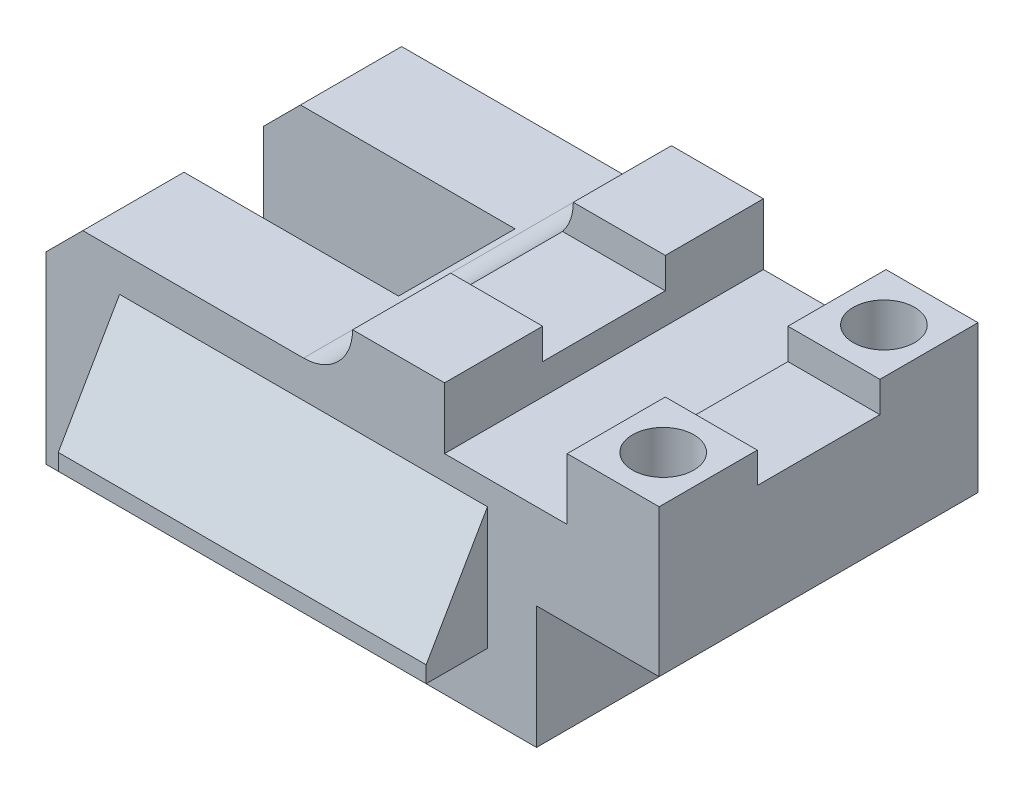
ISO-10303-21;
HEADER;
FILE_DESCRIPTION(('STEP AP214'),'2;1');
FILE_NAME('part.step','',(''),(''),'','','');
FILE_SCHEMA(('AUTOMOTIVE_DESIGN { 1 0 10303 214 1 1 1 1 }'));
ENDSEC;
DATA;
#1=APPLICATION_CONTEXT('core data for automotive mechanical design processes');
#2=APPLICATION_PROTOCOL_DEFINITION('international standard','automotive_design',2000,#1);
#3=PRODUCT_CONTEXT('',#1,'mechanical');
#4=PRODUCT('Part','Part','',(#3));
#5=PRODUCT_RELATED_PRODUCT_CATEGORY('part','',(#4));
#6=PRODUCT_DEFINITION_FORMATION('','',#4);
#7=PRODUCT_DEFINITION_CONTEXT('part definition',#1,'design');
#8=PRODUCT_DEFINITION('design','',#6,#7);
#9=PRODUCT_DEFINITION_SHAPE('','',#8);
#10=(LENGTH_UNIT() NAMED_UNIT(*) SI_UNIT(.MILLI.,.METRE.));
#11=(NAMED_UNIT(*) PLANE_ANGLE_UNIT() SI_UNIT($,.RADIAN.));
#12=(NAMED_UNIT(*) SI_UNIT($,.STERADIAN.) SOLID_ANGLE_UNIT());
#13=UNCERTAINTY_MEASURE_WITH_UNIT(LENGTH_MEASURE(1.E-05),#10,'distance_accuracy_value','');
#14=(GEOMETRIC_REPRESENTATION_CONTEXT(3) GLOBAL_UNCERTAINTY_ASSIGNED_CONTEXT((#13)) GLOBAL_UNIT_ASSIGNED_CONTEXT((#10,
#11,#12)) REPRESENTATION_CONTEXT('',''));
#15=CARTESIAN_POINT('',(0.,0.,0.));
#16=DIRECTION('',(0.,0.,1.));
#17=DIRECTION('',(1.,0.,0.));
#18=AXIS2_PLACEMENT_3D('',#15,#16,#17);
#19=CARTESIAN_POINT('',(0.,44.,26.));
#20=DIRECTION('',(0.,0.,-1.));
#21=DIRECTION('',(-1.,0.,0.));
#22=AXIS2_PLACEMENT_3D('',#19,#20,#21);
#23=PLANE('',#22);
#24=DIRECTION('',(1.,0.,0.));
#25=VECTOR('',#24,1.);
#26=CARTESIAN_POINT('',(0.,0.,26.));
#27=LINE('',#26,#25);
#28=CARTESIAN_POINT('',(-50.,0.,26.));
#29=VERTEX_POINT('',#28);
#30=CARTESIAN_POINT('',(30.,0.,26.));
#31=VERTEX_POINT('',#30);
#32=EDGE_CURVE('E473',#29,#31,#27,.T.);
#33=ORIENTED_EDGE('',*,*,#32,.T.);
#34=DIRECTION('',(0.,-1.,0.));
#35=VECTOR('',#34,1.);
#36=CARTESIAN_POINT('',(30.,0.,26.));
#37=LINE('',#36,#35);
#38=CARTESIAN_POINT('',(30.,20.,26.));
#39=VERTEX_POINT('',#38);
#40=EDGE_CURVE('E293',#39,#31,#37,.T.);
#41=ORIENTED_EDGE('',*,*,#40,.F.);
#42=DIRECTION('',(-1.,0.,0.));
#43=VECTOR('',#42,1.);
#44=CARTESIAN_POINT('',(50.,20.,26.));
#45=LINE('',#44,#43);
#46=CARTESIAN_POINT('',(50.,20.,26.));
#47=VERTEX_POINT('',#46);
#48=EDGE_CURVE('E265',#47,#39,#45,.T.);
#49=ORIENTED_EDGE('',*,*,#48,.F.);
#50=DIRECTION('',(0.,-1.,0.));
#51=VECTOR('',#50,1.);
#52=CARTESIAN_POINT('',(50.,44.,26.));
#53=LINE('',#52,#51);
#54=CARTESIAN_POINT('',(50.,44.,26.));
#55=VERTEX_POINT('',#54);
#56=EDGE_CURVE('E498',#55,#47,#53,.T.);
#57=ORIENTED_EDGE('',*,*,#56,.F.);
#58=DIRECTION('',(1.,0.,0.));
#59=VECTOR('',#58,1.);
#60=CARTESIAN_POINT('',(0.,44.,26.));
#61=LINE('',#60,#59);
#62=CARTESIAN_POINT('',(35.,44.,26.));
#63=VERTEX_POINT('',#62);
#64=EDGE_CURVE('E452',#63,#55,#61,.T.);
#65=ORIENTED_EDGE('',*,*,#64,.F.);
#66=DIRECTION('',(0.,1.,0.));
#67=VECTOR('',#66,1.);
#68=CARTESIAN_POINT('',(35.,34.,26.));
#69=LINE('',#68,#67);
#70=CARTESIAN_POINT('',(35.,34.,26.));
#71=VERTEX_POINT('',#70);
#72=EDGE_CURVE('E397',#71,#63,#69,.T.);
#73=ORIENTED_EDGE('',*,*,#72,.F.);
#74=DIRECTION('',(1.,0.,0.));
#75=VECTOR('',#74,1.);
#76=CARTESIAN_POINT('',(0.,34.,26.));
#77=LINE('',#76,#75);
#78=CARTESIAN_POINT('',(15.,34.,26.));
#79=VERTEX_POINT('',#78);
#80=EDGE_CURVE('E384',#79,#71,#77,.T.);
#81=ORIENTED_EDGE('',*,*,#80,.F.);
#82=DIRECTION('',(0.,1.,0.));
#83=VECTOR('',#82,1.);
#84=CARTESIAN_POINT('',(15.,34.,26.));
#85=LINE('',#84,#83);
#86=CARTESIAN_POINT('',(15.,44.,26.));
#87=VERTEX_POINT('',#86);
#88=EDGE_CURVE('E401',#79,#87,#85,.T.);
#89=ORIENTED_EDGE('',*,*,#88,.T.);
#90=CARTESIAN_POINT('',(0.,44.,26.));
#91=VERTEX_POINT('',#90);
#92=EDGE_CURVE('E448',#91,#87,#61,.T.);
#93=ORIENTED_EDGE('',*,*,#92,.F.);
#94=CARTESIAN_POINT('',(-7.99999999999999,44.,26.));
#95=DIRECTION('',(0.,0.,-1.));
#96=DIRECTION('',(-1.,0.,0.));
#97=AXIS2_PLACEMENT_3D('',#94,#95,#96);
#98=CIRCLE('',#97,8.);
#99=CARTESIAN_POINT('',(-7.99999999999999,36.,26.));
#100=VERTEX_POINT('',#99);
#101=EDGE_CURVE('E552',#91,#100,#98,.T.);
#102=ORIENTED_EDGE('',*,*,#101,.T.);
#103=DIRECTION('',(1.,0.,0.));
#104=VECTOR('',#103,1.);
#105=CARTESIAN_POINT('',(0.,36.,26.));
#106=LINE('',#105,#104);
#107=CARTESIAN_POINT('',(-44.,36.,26.));
#108=VERTEX_POINT('',#107);
#109=EDGE_CURVE('E340',#108,#100,#106,.T.);
#110=ORIENTED_EDGE('',*,*,#109,.F.);
#111=DIRECTION('',(-0.707106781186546,-0.707106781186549,0.));
#112=VECTOR('',#111,1.);
#113=CARTESIAN_POINT('',(-44.,36.,26.));
#114=LINE('',#113,#112);
#115=CARTESIAN_POINT('',(-50.,30.,26.));
#116=VERTEX_POINT('',#115);
#117=EDGE_CURVE('E519',#108,#116,#114,.T.);
#118=ORIENTED_EDGE('',*,*,#117,.T.);
#119=DIRECTION('',(0.,-1.,0.));
#120=VECTOR('',#119,1.);
#121=CARTESIAN_POINT('',(-50.,44.,26.));
#122=LINE('',#121,#120);
#123=EDGE_CURVE('E502',#116,#29,#122,.T.);
#124=ORIENTED_EDGE('',*,*,#123,.T.);
#125=EDGE_LOOP('',(#33,#41,#49,#57,#65,#73,#81,#89,#93,#102,#110,#118,#124));
#126=FACE_BOUND('',#125,.T.);
#127=DIRECTION('',(-1.,0.,0.));
#128=VECTOR('',#127,1.);
#129=CARTESIAN_POINT('',(22.,30.,26.));
#130=LINE('',#129,#128);
#131=CARTESIAN_POINT('',(22.,30.,26.));
#132=VERTEX_POINT('',#131);
#133=CARTESIAN_POINT('',(-38.,30.,26.));
#134=VERTEX_POINT('',#133);
#135=EDGE_CURVE('E276',#132,#134,#130,.T.);
#136=ORIENTED_EDGE('',*,*,#135,.F.);
#137=DIRECTION('',(0.,1.,0.));
#138=VECTOR('',#137,1.);
#139=CARTESIAN_POINT('',(22.,10.,26.));
#140=LINE('',#139,#138);
#141=CARTESIAN_POINT('',(22.,10.,26.));
#142=VERTEX_POINT('',#141);
#143=EDGE_CURVE('E254',#142,#132,#140,.T.);
#144=ORIENTED_EDGE('',*,*,#143,.F.);
#145=DIRECTION('',(1.,0.,0.));
#146=VECTOR('',#145,1.);
#147=CARTESIAN_POINT('',(-38.,10.,26.));
#148=LINE('',#147,#146);
#149=CARTESIAN_POINT('',(-38.,10.,26.));
#150=VERTEX_POINT('',#149);
#151=EDGE_CURVE('E281',#150,#142,#148,.T.);
#152=ORIENTED_EDGE('',*,*,#151,.F.);
#153=DIRECTION('',(0.,-1.,0.));
#154=VECTOR('',#153,1.);
#155=CARTESIAN_POINT('',(-38.,30.,26.));
#156=LINE('',#155,#154);
#157=EDGE_CURVE('E261',#134,#150,#156,.T.);
#158=ORIENTED_EDGE('',*,*,#157,.F.);
#159=EDGE_LOOP('',(#136,#144,#152,#158));
#160=FACE_BOUND('',#159,.T.);
#161=ADVANCED_FACE('F47',(#126,#160),#23,.F.);
#162=CARTESIAN_POINT('',(0.,44.,-26.));
#163=DIRECTION('',(0.,0.,-1.));
#164=DIRECTION('',(-1.,0.,0.));
#165=AXIS2_PLACEMENT_3D('',#162,#163,#164);
#166=PLANE('',#165);
#167=DIRECTION('',(0.,-1.,0.));
#168=VECTOR('',#167,1.);
#169=CARTESIAN_POINT('',(30.,0.,-26.));
#170=LINE('',#169,#168);
#171=CARTESIAN_POINT('',(30.,20.,-26.));
#172=VERTEX_POINT('',#171);
#173=CARTESIAN_POINT('',(30.,0.,-26.));
#174=VERTEX_POINT('',#173);
#175=EDGE_CURVE('E292',#172,#174,#170,.T.);
#176=ORIENTED_EDGE('',*,*,#175,.T.);
#177=DIRECTION('',(1.,0.,0.));
#178=VECTOR('',#177,1.);
#179=CARTESIAN_POINT('',(0.,0.,-26.));
#180=LINE('',#179,#178);
#181=CARTESIAN_POINT('',(-50.,0.,-26.));
#182=VERTEX_POINT('',#181);
#183=EDGE_CURVE('E478',#182,#174,#180,.T.);
#184=ORIENTED_EDGE('',*,*,#183,.F.);
#185=DIRECTION('',(0.,-1.,0.));
#186=VECTOR('',#185,1.);
#187=CARTESIAN_POINT('',(-50.,44.,-26.));
#188=LINE('',#187,#186);
#189=CARTESIAN_POINT('',(-50.,30.,-26.));
#190=VERTEX_POINT('',#189);
#191=EDGE_CURVE('E491',#190,#182,#188,.T.);
#192=ORIENTED_EDGE('',*,*,#191,.F.);
#193=DIRECTION('',(0.707106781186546,0.707106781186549,0.));
#194=VECTOR('',#193,1.);
#195=CARTESIAN_POINT('',(-18.0000000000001,62.,-26.));
#196=LINE('',#195,#194);
#197=CARTESIAN_POINT('',(-44.,36.,-26.));
#198=VERTEX_POINT('',#197);
#199=EDGE_CURVE('E534',#190,#198,#196,.T.);
#200=ORIENTED_EDGE('',*,*,#199,.T.);
#201=DIRECTION('',(-1.,0.,0.));
#202=VECTOR('',#201,1.);
#203=CARTESIAN_POINT('',(0.,36.,-26.));
#204=LINE('',#203,#202);
#205=CARTESIAN_POINT('',(-8.00000000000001,36.,-26.));
#206=VERTEX_POINT('',#205);
#207=EDGE_CURVE('E326',#206,#198,#204,.T.);
#208=ORIENTED_EDGE('',*,*,#207,.F.);
#209=CARTESIAN_POINT('',(-8.00000000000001,44.,-26.));
#210=DIRECTION('',(0.,0.,-1.));
#211=DIRECTION('',(-1.,0.,0.));
#212=AXIS2_PLACEMENT_3D('',#209,#210,#211);
#213=CIRCLE('',#212,8.);
#214=CARTESIAN_POINT('',(0.,44.,-26.));
#215=VERTEX_POINT('',#214);
#216=EDGE_CURVE('E555',#206,#215,#213,.F.);
#217=ORIENTED_EDGE('',*,*,#216,.T.);
#218=DIRECTION('',(1.,0.,0.));
#219=VECTOR('',#218,1.);
#220=CARTESIAN_POINT('',(0.,44.,-26.));
#221=LINE('',#220,#219);
#222=CARTESIAN_POINT('',(15.,44.,-26.));
#223=VERTEX_POINT('',#222);
#224=EDGE_CURVE('E458',#215,#223,#221,.T.);
#225=ORIENTED_EDGE('',*,*,#224,.T.);
#226=DIRECTION('',(0.,1.,0.));
#227=VECTOR('',#226,1.);
#228=CARTESIAN_POINT('',(15.,34.,-26.));
#229=LINE('',#228,#227);
#230=CARTESIAN_POINT('',(15.,34.,-26.));
#231=VERTEX_POINT('',#230);
#232=EDGE_CURVE('E405',#231,#223,#229,.T.);
#233=ORIENTED_EDGE('',*,*,#232,.F.);
#234=DIRECTION('',(-1.,0.,0.));
#235=VECTOR('',#234,1.);
#236=CARTESIAN_POINT('',(0.,34.,-26.));
#237=LINE('',#236,#235);
#238=CARTESIAN_POINT('',(35.,34.,-26.));
#239=VERTEX_POINT('',#238);
#240=EDGE_CURVE('E375',#239,#231,#237,.T.);
#241=ORIENTED_EDGE('',*,*,#240,.F.);
#242=DIRECTION('',(0.,1.,0.));
#243=VECTOR('',#242,1.);
#244=CARTESIAN_POINT('',(35.,34.,-26.));
#245=LINE('',#244,#243);
#246=CARTESIAN_POINT('',(35.,44.,-26.));
#247=VERTEX_POINT('',#246);
#248=EDGE_CURVE('E388',#239,#247,#245,.T.);
#249=ORIENTED_EDGE('',*,*,#248,.T.);
#250=CARTESIAN_POINT('',(50.,44.,-26.));
#251=VERTEX_POINT('',#250);
#252=EDGE_CURVE('E457',#247,#251,#221,.T.);
#253=ORIENTED_EDGE('',*,*,#252,.T.);
#254=DIRECTION('',(0.,-1.,0.));
#255=VECTOR('',#254,1.);
#256=CARTESIAN_POINT('',(50.,44.,-26.));
#257=LINE('',#256,#255);
#258=CARTESIAN_POINT('',(50.,20.,-26.));
#259=VERTEX_POINT('',#258);
#260=EDGE_CURVE('E494',#251,#259,#257,.T.);
#261=ORIENTED_EDGE('',*,*,#260,.T.);
#262=DIRECTION('',(-1.,0.,0.));
#263=VECTOR('',#262,1.);
#264=CARTESIAN_POINT('',(50.,20.,-26.));
#265=LINE('',#264,#263);
#266=EDGE_CURVE('E288',#259,#172,#265,.T.);
#267=ORIENTED_EDGE('',*,*,#266,.T.);
#268=EDGE_LOOP('',(#176,#184,#192,#200,#208,#217,#225,#233,#241,#249,#253,#261,#267));
#269=FACE_BOUND('',#268,.T.);
#270=ADVANCED_FACE('F571',(#269),#166,.T.);
#271=CARTESIAN_POINT('',(-8.99999999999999,44.,0.));
#272=DIRECTION('',(1.,0.,0.));
#273=DIRECTION('',(0.,0.,-1.));
#274=AXIS2_PLACEMENT_3D('',#271,#272,#273);
#275=PLANE('',#274);
#276=DIRECTION('',(0.,0.,1.));
#277=VECTOR('',#276,1.);
#278=CARTESIAN_POINT('',(-8.99999999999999,36.,0.));
#279=LINE('',#278,#277);
#280=CARTESIAN_POINT('',(-8.99999999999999,36.,-9.5));
#281=VERTEX_POINT('',#280);
#282=CARTESIAN_POINT('',(-8.99999999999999,36.,9.5));
#283=VERTEX_POINT('',#282);
#284=EDGE_CURVE('E333',#281,#283,#279,.T.);
#285=ORIENTED_EDGE('',*,*,#284,.F.);
#286=DIRECTION('',(0.,-1.,0.));
#287=VECTOR('',#286,1.);
#288=CARTESIAN_POINT('',(-8.99999999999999,44.,-9.5));
#289=LINE('',#288,#287);
#290=CARTESIAN_POINT('',(-8.99999999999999,0.,-9.5));
#291=VERTEX_POINT('',#290);
#292=EDGE_CURVE('E461',#281,#291,#289,.T.);
#293=ORIENTED_EDGE('',*,*,#292,.T.);
#294=DIRECTION('',(0.,0.,1.));
#295=VECTOR('',#294,1.);
#296=CARTESIAN_POINT('',(-8.99999999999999,0.,0.));
#297=LINE('',#296,#295);
#298=CARTESIAN_POINT('',(-8.99999999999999,0.,9.5));
#299=VERTEX_POINT('',#298);
#300=EDGE_CURVE('E437',#291,#299,#297,.T.);
#301=ORIENTED_EDGE('',*,*,#300,.T.);
#302=DIRECTION('',(0.,-1.,0.));
#303=VECTOR('',#302,1.);
#304=CARTESIAN_POINT('',(-8.99999999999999,44.,9.5));
#305=LINE('',#304,#303);
#306=EDGE_CURVE('E508',#283,#299,#305,.T.);
#307=ORIENTED_EDGE('',*,*,#306,.F.);
#308=EDGE_LOOP('',(#285,#293,#301,#307));
#309=FACE_BOUND('',#308,.T.);
#310=ADVANCED_FACE('F577',(#309),#275,.F.);
#311=CARTESIAN_POINT('',(0.,44.,9.5));
#312=DIRECTION('',(0.,0.,1.));
#313=DIRECTION('',(1.,0.,0.));
#314=AXIS2_PLACEMENT_3D('',#311,#312,#313);
#315=PLANE('',#314);
#316=DIRECTION('',(0.,-1.,0.));
#317=VECTOR('',#316,1.);
#318=CARTESIAN_POINT('',(-50.,44.,9.5));
#319=LINE('',#318,#317);
#320=CARTESIAN_POINT('',(-50.,30.,9.5));
#321=VERTEX_POINT('',#320);
#322=CARTESIAN_POINT('',(-50.,0.,9.5));
#323=VERTEX_POINT('',#322);
#324=EDGE_CURVE('E505',#321,#323,#319,.T.);
#325=ORIENTED_EDGE('',*,*,#324,.F.);
#326=DIRECTION('',(0.707106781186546,0.707106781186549,0.));
#327=VECTOR('',#326,1.);
#328=CARTESIAN_POINT('',(-44.,36.,9.5));
#329=LINE('',#328,#327);
#330=CARTESIAN_POINT('',(-44.,36.,9.5));
#331=VERTEX_POINT('',#330);
#332=EDGE_CURVE('E525',#321,#331,#329,.T.);
#333=ORIENTED_EDGE('',*,*,#332,.T.);
#334=DIRECTION('',(-1.,0.,0.));
#335=VECTOR('',#334,1.);
#336=CARTESIAN_POINT('',(0.,36.,9.5));
#337=LINE('',#336,#335);
#338=EDGE_CURVE('E336',#283,#331,#337,.T.);
#339=ORIENTED_EDGE('',*,*,#338,.F.);
#340=ORIENTED_EDGE('',*,*,#306,.T.);
#341=DIRECTION('',(-1.,0.,0.));
#342=VECTOR('',#341,1.);
#343=CARTESIAN_POINT('',(0.,0.,9.5));
#344=LINE('',#343,#342);
#345=EDGE_CURVE('E465',#299,#323,#344,.T.);
#346=ORIENTED_EDGE('',*,*,#345,.T.);
#347=EDGE_LOOP('',(#325,#333,#339,#340,#346));
#348=FACE_BOUND('',#347,.T.);
#349=ADVANCED_FACE('F583',(#348),#315,.F.);
#350=CARTESIAN_POINT('',(-50.,44.,0.));
#351=DIRECTION('',(1.,0.,0.));
#352=DIRECTION('',(0.,0.,-1.));
#353=AXIS2_PLACEMENT_3D('',#350,#351,#352);
#354=PLANE('',#353);
#355=ORIENTED_EDGE('',*,*,#123,.F.);
#356=DIRECTION('',(0.,0.,-1.));
#357=VECTOR('',#356,1.);
#358=CARTESIAN_POINT('',(-50.,30.,9.5));
#359=LINE('',#358,#357);
#360=EDGE_CURVE('E522',#116,#321,#359,.T.);
#361=ORIENTED_EDGE('',*,*,#360,.T.);
#362=ORIENTED_EDGE('',*,*,#324,.T.);
#363=DIRECTION('',(0.,0.,1.));
#364=VECTOR('',#363,1.);
#365=CARTESIAN_POINT('',(-50.,0.,0.));
#366=LINE('',#365,#364);
#367=EDGE_CURVE('E469',#323,#29,#366,.T.);
#368=ORIENTED_EDGE('',*,*,#367,.T.);
#369=EDGE_LOOP('',(#355,#361,#362,#368));
#370=FACE_BOUND('',#369,.T.);
#371=ADVANCED_FACE('F586',(#370),#354,.F.);
#372=DIRECTION('',(0.,-1.,0.));
#373=VECTOR('',#372,1.);
#374=CARTESIAN_POINT('',(-50.,44.,-9.5));
#375=LINE('',#374,#373);
#376=CARTESIAN_POINT('',(-50.,30.,-9.5));
#377=VERTEX_POINT('',#376);
#378=CARTESIAN_POINT('',(-50.,0.,-9.5));
#379=VERTEX_POINT('',#378);
#380=EDGE_CURVE('E488',#377,#379,#375,.T.);
#381=ORIENTED_EDGE('',*,*,#380,.F.);
#382=DIRECTION('',(0.,0.,-1.));
#383=VECTOR('',#382,1.);
#384=CARTESIAN_POINT('',(-50.,30.,-26.));
#385=LINE('',#384,#383);
#386=EDGE_CURVE('E531',#377,#190,#385,.T.);
#387=ORIENTED_EDGE('',*,*,#386,.T.);
#388=ORIENTED_EDGE('',*,*,#191,.T.);
#389=EDGE_CURVE('E474',#182,#379,#366,.T.);
#390=ORIENTED_EDGE('',*,*,#389,.T.);
#391=EDGE_LOOP('',(#381,#387,#388,#390));
#392=FACE_BOUND('',#391,.T.);
#393=ADVANCED_FACE('F714',(#392),#354,.F.);
#394=CARTESIAN_POINT('',(0.,44.,-9.5));
#395=DIRECTION('',(0.,0.,-1.));
#396=DIRECTION('',(-1.,0.,0.));
#397=AXIS2_PLACEMENT_3D('',#394,#395,#396);
#398=PLANE('',#397);
#399=DIRECTION('',(1.,0.,0.));
#400=VECTOR('',#399,1.);
#401=CARTESIAN_POINT('',(0.,36.,-9.5));
#402=LINE('',#401,#400);
#403=CARTESIAN_POINT('',(-44.,36.,-9.5));
#404=VERTEX_POINT('',#403);
#405=EDGE_CURVE('E329',#404,#281,#402,.T.);
#406=ORIENTED_EDGE('',*,*,#405,.F.);
#407=DIRECTION('',(-0.707106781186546,-0.707106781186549,0.));
#408=VECTOR('',#407,1.);
#409=CARTESIAN_POINT('',(-44.,36.,-9.5));
#410=LINE('',#409,#408);
#411=EDGE_CURVE('E528',#404,#377,#410,.T.);
#412=ORIENTED_EDGE('',*,*,#411,.T.);
#413=ORIENTED_EDGE('',*,*,#380,.T.);
#414=DIRECTION('',(1.,0.,0.));
#415=VECTOR('',#414,1.);
#416=CARTESIAN_POINT('',(0.,0.,-9.5));
#417=LINE('',#416,#415);
#418=EDGE_CURVE('E482',#379,#291,#417,.T.);
#419=ORIENTED_EDGE('',*,*,#418,.T.);
#420=ORIENTED_EDGE('',*,*,#292,.F.);
#421=EDGE_LOOP('',(#406,#412,#413,#419,#420));
#422=FACE_BOUND('',#421,.T.);
#423=ADVANCED_FACE('F707',(#422),#398,.F.);
#424=CARTESIAN_POINT('',(0.,44.,0.));
#425=DIRECTION('',(0.,1.,0.));
#426=DIRECTION('',(0.,0.,1.));
#427=AXIS2_PLACEMENT_3D('',#424,#425,#426);
#428=PLANE('',#427);
#429=ORIENTED_EDGE('',*,*,#224,.F.);
#430=DIRECTION('',(0.,0.,1.));
#431=VECTOR('',#430,1.);
#432=CARTESIAN_POINT('',(0.,44.,0.));
#433=LINE('',#432,#431);
#434=CARTESIAN_POINT('',(0.,44.,-9.99999999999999));
#435=VERTEX_POINT('',#434);
#436=EDGE_CURVE('E330',#215,#435,#433,.T.);
#437=ORIENTED_EDGE('',*,*,#436,.T.);
#438=DIRECTION('',(-1.,0.,0.));
#439=VECTOR('',#438,1.);
#440=CARTESIAN_POINT('',(0.,44.,-9.99999999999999));
#441=LINE('',#440,#439);
#442=CARTESIAN_POINT('',(15.,44.,-10.));
#443=VERTEX_POINT('',#442);
#444=EDGE_CURVE('E352',#443,#435,#441,.T.);
#445=ORIENTED_EDGE('',*,*,#444,.F.);
#446=DIRECTION('',(0.,0.,1.));
#447=VECTOR('',#446,1.);
#448=CARTESIAN_POINT('',(15.,44.,0.));
#449=LINE('',#448,#447);
#450=EDGE_CURVE('E376',#223,#443,#449,.T.);
#451=ORIENTED_EDGE('',*,*,#450,.F.);
#452=EDGE_LOOP('',(#429,#437,#445,#451));
#453=FACE_BOUND('',#452,.T.);
#454=ADVANCED_FACE('F624',(#453),#428,.T.);
#455=DIRECTION('',(1.,0.,0.));
#456=VECTOR('',#455,1.);
#457=CARTESIAN_POINT('',(0.,44.,10.));
#458=LINE('',#457,#456);
#459=CARTESIAN_POINT('',(0.,44.,10.));
#460=VERTEX_POINT('',#459);
#461=CARTESIAN_POINT('',(15.,44.,10.));
#462=VERTEX_POINT('',#461);
#463=EDGE_CURVE('E344',#460,#462,#458,.T.);
#464=ORIENTED_EDGE('',*,*,#463,.F.);
#465=EDGE_CURVE('E322',#460,#91,#433,.T.);
#466=ORIENTED_EDGE('',*,*,#465,.T.);
#467=ORIENTED_EDGE('',*,*,#92,.T.);
#468=EDGE_CURVE('E393',#462,#87,#449,.T.);
#469=ORIENTED_EDGE('',*,*,#468,.F.);
#470=EDGE_LOOP('',(#464,#466,#467,#469));
#471=FACE_BOUND('',#470,.T.);
#472=ADVANCED_FACE('F666',(#471),#428,.T.);
#473=CARTESIAN_POINT('',(42.6566955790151,44.,-18.));
#474=DIRECTION('',(0.,1.,0.));
#475=DIRECTION('',(0.,0.,1.));
#476=AXIS2_PLACEMENT_3D('',#473,#474,#475);
#477=CIRCLE('',#476,5.);
#478=CARTESIAN_POINT('',(42.6566955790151,44.,-13.));
#479=VERTEX_POINT('',#478);
#480=EDGE_CURVE('E318',#479,#479,#477,.T.);
#481=ORIENTED_EDGE('',*,*,#480,.F.);
#482=EDGE_LOOP('',(#481));
#483=FACE_BOUND('',#482,.T.);
#484=ORIENTED_EDGE('',*,*,#252,.F.);
#485=DIRECTION('',(0.,0.,1.));
#486=VECTOR('',#485,1.);
#487=CARTESIAN_POINT('',(35.,44.,0.));
#488=LINE('',#487,#486);
#489=CARTESIAN_POINT('',(35.,44.,-9.99999999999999));
#490=VERTEX_POINT('',#489);
#491=EDGE_CURVE('E389',#247,#490,#488,.T.);
#492=ORIENTED_EDGE('',*,*,#491,.T.);
#493=DIRECTION('',(-1.,0.,0.));
#494=VECTOR('',#493,1.);
#495=CARTESIAN_POINT('',(0.,44.,-9.99999999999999));
#496=LINE('',#495,#494);
#497=CARTESIAN_POINT('',(50.,44.,-10.));
#498=VERTEX_POINT('',#497);
#499=EDGE_CURVE('E417',#498,#490,#496,.T.);
#500=ORIENTED_EDGE('',*,*,#499,.F.);
#501=DIRECTION('',(0.,0.,1.));
#502=VECTOR('',#501,1.);
#503=CARTESIAN_POINT('',(50.,44.,0.));
#504=LINE('',#503,#502);
#505=EDGE_CURVE('E453',#251,#498,#504,.T.);
#506=ORIENTED_EDGE('',*,*,#505,.F.);
#507=EDGE_LOOP('',(#484,#492,#500,#506));
#508=FACE_BOUND('',#507,.T.);
#509=ADVANCED_FACE('F642',(#483,#508),#428,.T.);
#510=CARTESIAN_POINT('',(42.6566955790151,44.,18.));
#511=DIRECTION('',(0.,1.,0.));
#512=DIRECTION('',(0.,0.,1.));
#513=AXIS2_PLACEMENT_3D('',#510,#511,#512);
#514=CIRCLE('',#513,5.);
#515=CARTESIAN_POINT('',(42.6566955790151,44.,23.));
#516=VERTEX_POINT('',#515);
#517=EDGE_CURVE('E317',#516,#516,#514,.T.);
#518=ORIENTED_EDGE('',*,*,#517,.F.);
#519=EDGE_LOOP('',(#518));
#520=FACE_BOUND('',#519,.T.);
#521=DIRECTION('',(1.,0.,0.));
#522=VECTOR('',#521,1.);
#523=CARTESIAN_POINT('',(0.,44.,10.));
#524=LINE('',#523,#522);
#525=CARTESIAN_POINT('',(35.,44.,10.));
#526=VERTEX_POINT('',#525);
#527=CARTESIAN_POINT('',(50.,44.,10.));
#528=VERTEX_POINT('',#527);
#529=EDGE_CURVE('E400',#526,#528,#524,.T.);
#530=ORIENTED_EDGE('',*,*,#529,.F.);
#531=EDGE_CURVE('E368',#526,#63,#488,.T.);
#532=ORIENTED_EDGE('',*,*,#531,.T.);
#533=ORIENTED_EDGE('',*,*,#64,.T.);
#534=EDGE_CURVE('E451',#528,#55,#504,.T.);
#535=ORIENTED_EDGE('',*,*,#534,.F.);
#536=EDGE_LOOP('',(#530,#532,#533,#535));
#537=FACE_BOUND('',#536,.T.);
#538=ADVANCED_FACE('F708',(#520,#537),#428,.T.);
#539=CARTESIAN_POINT('',(50.,44.,0.));
#540=DIRECTION('',(1.,0.,0.));
#541=DIRECTION('',(0.,0.,-1.));
#542=AXIS2_PLACEMENT_3D('',#539,#540,#541);
#543=PLANE('',#542);
#544=DIRECTION('',(0.,0.,1.));
#545=VECTOR('',#544,1.);
#546=CARTESIAN_POINT('',(50.,20.,-26.));
#547=LINE('',#546,#545);
#548=EDGE_CURVE('E297',#259,#47,#547,.T.);
#549=ORIENTED_EDGE('',*,*,#548,.F.);
#550=ORIENTED_EDGE('',*,*,#260,.F.);
#551=ORIENTED_EDGE('',*,*,#505,.T.);
#552=DIRECTION('',(0.,1.,0.));
#553=VECTOR('',#552,1.);
#554=CARTESIAN_POINT('',(50.,39.,-10.));
#555=LINE('',#554,#553);
#556=CARTESIAN_POINT('',(50.,39.,-10.));
#557=VERTEX_POINT('',#556);
#558=EDGE_CURVE('E438',#557,#498,#555,.T.);
#559=ORIENTED_EDGE('',*,*,#558,.F.);
#560=DIRECTION('',(0.,0.,-1.));
#561=VECTOR('',#560,1.);
#562=CARTESIAN_POINT('',(50.,39.,0.));
#563=LINE('',#562,#561);
#564=CARTESIAN_POINT('',(50.,39.,10.));
#565=VERTEX_POINT('',#564);
#566=EDGE_CURVE('E421',#565,#557,#563,.T.);
#567=ORIENTED_EDGE('',*,*,#566,.F.);
#568=DIRECTION('',(0.,1.,0.));
#569=VECTOR('',#568,1.);
#570=CARTESIAN_POINT('',(50.,39.,10.));
#571=LINE('',#570,#569);
#572=EDGE_CURVE('E441',#565,#528,#571,.T.);
#573=ORIENTED_EDGE('',*,*,#572,.T.);
#574=ORIENTED_EDGE('',*,*,#534,.T.);
#575=ORIENTED_EDGE('',*,*,#56,.T.);
#576=EDGE_LOOP('',(#549,#550,#551,#559,#567,#573,#574,#575));
#577=FACE_BOUND('',#576,.T.);
#578=ADVANCED_FACE('F582',(#577),#543,.T.);
#579=CARTESIAN_POINT('',(0.,0.,0.));
#580=DIRECTION('',(0.,1.,0.));
#581=DIRECTION('',(0.,0.,1.));
#582=AXIS2_PLACEMENT_3D('',#579,#580,#581);
#583=PLANE('',#582);
#584=ORIENTED_EDGE('',*,*,#183,.T.);
#585=DIRECTION('',(0.,0.,1.));
#586=VECTOR('',#585,1.);
#587=CARTESIAN_POINT('',(30.,0.,-26.));
#588=LINE('',#587,#586);
#589=EDGE_CURVE('E303',#174,#31,#588,.T.);
#590=ORIENTED_EDGE('',*,*,#589,.T.);
#591=ORIENTED_EDGE('',*,*,#32,.F.);
#592=ORIENTED_EDGE('',*,*,#367,.F.);
#593=ORIENTED_EDGE('',*,*,#345,.F.);
#594=ORIENTED_EDGE('',*,*,#300,.F.);
#595=ORIENTED_EDGE('',*,*,#418,.F.);
#596=ORIENTED_EDGE('',*,*,#389,.F.);
#597=EDGE_LOOP('',(#584,#590,#591,#592,#593,#594,#595,#596));
#598=FACE_BOUND('',#597,.T.);
#599=ADVANCED_FACE('F701',(#598),#583,.F.);
#600=CARTESIAN_POINT('',(0.,39.,-9.99999999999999));
#601=DIRECTION('',(0.,0.,-1.));
#602=DIRECTION('',(-1.,0.,0.));
#603=AXIS2_PLACEMENT_3D('',#600,#601,#602);
#604=PLANE('',#603);
#605=ORIENTED_EDGE('',*,*,#499,.T.);
#606=DIRECTION('',(0.,1.,0.));
#607=VECTOR('',#606,1.);
#608=CARTESIAN_POINT('',(35.,39.,-9.99999999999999));
#609=LINE('',#608,#607);
#610=CARTESIAN_POINT('',(35.,39.,-10.));
#611=VERTEX_POINT('',#610);
#612=EDGE_CURVE('E434',#611,#490,#609,.T.);
#613=ORIENTED_EDGE('',*,*,#612,.F.);
#614=DIRECTION('',(-1.,0.,0.));
#615=VECTOR('',#614,1.);
#616=CARTESIAN_POINT('',(0.,39.,-9.99999999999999));
#617=LINE('',#616,#615);
#618=EDGE_CURVE('E424',#557,#611,#617,.T.);
#619=ORIENTED_EDGE('',*,*,#618,.F.);
#620=ORIENTED_EDGE('',*,*,#558,.T.);
#621=EDGE_LOOP('',(#605,#613,#619,#620));
#622=FACE_BOUND('',#621,.T.);
#623=ADVANCED_FACE('F645',(#622),#604,.F.);
#624=CARTESIAN_POINT('',(0.,39.,10.));
#625=DIRECTION('',(0.,0.,1.));
#626=DIRECTION('',(1.,0.,0.));
#627=AXIS2_PLACEMENT_3D('',#624,#625,#626);
#628=PLANE('',#627);
#629=ORIENTED_EDGE('',*,*,#529,.T.);
#630=ORIENTED_EDGE('',*,*,#572,.F.);
#631=DIRECTION('',(1.,0.,0.));
#632=VECTOR('',#631,1.);
#633=CARTESIAN_POINT('',(0.,39.,10.));
#634=LINE('',#633,#632);
#635=CARTESIAN_POINT('',(35.,39.,10.));
#636=VERTEX_POINT('',#635);
#637=EDGE_CURVE('E416',#636,#565,#634,.T.);
#638=ORIENTED_EDGE('',*,*,#637,.F.);
#639=DIRECTION('',(0.,1.,0.));
#640=VECTOR('',#639,1.);
#641=CARTESIAN_POINT('',(35.,39.,10.));
#642=LINE('',#641,#640);
#643=EDGE_CURVE('E428',#636,#526,#642,.T.);
#644=ORIENTED_EDGE('',*,*,#643,.T.);
#645=EDGE_LOOP('',(#629,#630,#638,#644));
#646=FACE_BOUND('',#645,.T.);
#647=ADVANCED_FACE('F697',(#646),#628,.F.);
#648=CARTESIAN_POINT('',(0.,39.,0.));
#649=DIRECTION('',(0.,1.,0.));
#650=DIRECTION('',(0.,0.,1.));
#651=AXIS2_PLACEMENT_3D('',#648,#649,#650);
#652=PLANE('',#651);
#653=DIRECTION('',(0.,0.,1.));
#654=VECTOR('',#653,1.);
#655=CARTESIAN_POINT('',(35.,39.,0.));
#656=LINE('',#655,#654);
#657=EDGE_CURVE('E412',#611,#636,#656,.T.);
#658=ORIENTED_EDGE('',*,*,#657,.T.);
#659=ORIENTED_EDGE('',*,*,#637,.T.);
#660=ORIENTED_EDGE('',*,*,#566,.T.);
#661=ORIENTED_EDGE('',*,*,#618,.T.);
#662=EDGE_LOOP('',(#658,#659,#660,#661));
#663=FACE_BOUND('',#662,.T.);
#664=ADVANCED_FACE('F694',(#663),#652,.T.);
#665=CARTESIAN_POINT('',(35.,34.,0.));
#666=DIRECTION('',(-1.,0.,0.));
#667=DIRECTION('',(0.,0.,1.));
#668=AXIS2_PLACEMENT_3D('',#665,#666,#667);
#669=PLANE('',#668);
#670=ORIENTED_EDGE('',*,*,#612,.T.);
#671=ORIENTED_EDGE('',*,*,#491,.F.);
#672=ORIENTED_EDGE('',*,*,#248,.F.);
#673=DIRECTION('',(0.,0.,1.));
#674=VECTOR('',#673,1.);
#675=CARTESIAN_POINT('',(35.,34.,0.));
#676=LINE('',#675,#674);
#677=EDGE_CURVE('E372',#239,#71,#676,.T.);
#678=ORIENTED_EDGE('',*,*,#677,.T.);
#679=ORIENTED_EDGE('',*,*,#72,.T.);
#680=ORIENTED_EDGE('',*,*,#531,.F.);
#681=ORIENTED_EDGE('',*,*,#643,.F.);
#682=ORIENTED_EDGE('',*,*,#657,.F.);
#683=EDGE_LOOP('',(#670,#671,#672,#678,#679,#680,#681,#682));
#684=FACE_BOUND('',#683,.T.);
#685=ADVANCED_FACE('F637',(#684),#669,.T.);
#686=CARTESIAN_POINT('',(15.,34.,0.));
#687=DIRECTION('',(-1.,0.,0.));
#688=DIRECTION('',(0.,0.,1.));
#689=AXIS2_PLACEMENT_3D('',#686,#687,#688);
#690=PLANE('',#689);
#691=ORIENTED_EDGE('',*,*,#450,.T.);
#692=DIRECTION('',(0.,1.,0.));
#693=VECTOR('',#692,1.);
#694=CARTESIAN_POINT('',(15.,39.,-10.));
#695=LINE('',#694,#693);
#696=CARTESIAN_POINT('',(15.,39.,-10.));
#697=VERTEX_POINT('',#696);
#698=EDGE_CURVE('E365',#697,#443,#695,.T.);
#699=ORIENTED_EDGE('',*,*,#698,.F.);
#700=DIRECTION('',(0.,0.,1.));
#701=VECTOR('',#700,1.);
#702=CARTESIAN_POINT('',(15.,39.,0.));
#703=LINE('',#702,#701);
#704=CARTESIAN_POINT('',(15.,39.,10.));
#705=VERTEX_POINT('',#704);
#706=EDGE_CURVE('E351',#697,#705,#703,.T.);
#707=ORIENTED_EDGE('',*,*,#706,.T.);
#708=DIRECTION('',(0.,1.,0.));
#709=VECTOR('',#708,1.);
#710=CARTESIAN_POINT('',(15.,39.,10.));
#711=LINE('',#710,#709);
#712=EDGE_CURVE('E359',#705,#462,#711,.T.);
#713=ORIENTED_EDGE('',*,*,#712,.T.);
#714=ORIENTED_EDGE('',*,*,#468,.T.);
#715=ORIENTED_EDGE('',*,*,#88,.F.);
#716=DIRECTION('',(0.,0.,1.));
#717=VECTOR('',#716,1.);
#718=CARTESIAN_POINT('',(15.,34.,0.));
#719=LINE('',#718,#717);
#720=EDGE_CURVE('E380',#231,#79,#719,.T.);
#721=ORIENTED_EDGE('',*,*,#720,.F.);
#722=ORIENTED_EDGE('',*,*,#232,.T.);
#723=EDGE_LOOP('',(#691,#699,#707,#713,#714,#715,#721,#722));
#724=FACE_BOUND('',#723,.T.);
#725=ADVANCED_FACE('F628',(#724),#690,.F.);
#726=CARTESIAN_POINT('',(0.,34.,0.));
#727=DIRECTION('',(0.,1.,0.));
#728=DIRECTION('',(0.,0.,1.));
#729=AXIS2_PLACEMENT_3D('',#726,#727,#728);
#730=PLANE('',#729);
#731=ORIENTED_EDGE('',*,*,#677,.F.);
#732=ORIENTED_EDGE('',*,*,#240,.T.);
#733=ORIENTED_EDGE('',*,*,#720,.T.);
#734=ORIENTED_EDGE('',*,*,#80,.T.);
#735=EDGE_LOOP('',(#731,#732,#733,#734));
#736=FACE_BOUND('',#735,.T.);
#737=ADVANCED_FACE('F633',(#736),#730,.T.);
#738=CARTESIAN_POINT('',(0.,39.,-9.99999999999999));
#739=DIRECTION('',(0.,0.,-1.));
#740=DIRECTION('',(-1.,0.,0.));
#741=AXIS2_PLACEMENT_3D('',#738,#739,#740);
#742=PLANE('',#741);
#743=ORIENTED_EDGE('',*,*,#444,.T.);
#744=CARTESIAN_POINT('',(-8.,44.,-9.99999999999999));
#745=DIRECTION('',(0.,0.,-1.));
#746=DIRECTION('',(-1.,0.,0.));
#747=AXIS2_PLACEMENT_3D('',#744,#745,#746);
#748=CIRCLE('',#747,8.);
#749=CARTESIAN_POINT('',(-1.7550020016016,39.,-9.99999999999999));
#750=VERTEX_POINT('',#749);
#751=EDGE_CURVE('E541',#435,#750,#748,.T.);
#752=ORIENTED_EDGE('',*,*,#751,.T.);
#753=DIRECTION('',(-1.,0.,0.));
#754=VECTOR('',#753,1.);
#755=CARTESIAN_POINT('',(0.,39.,-9.99999999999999));
#756=LINE('',#755,#754);
#757=EDGE_CURVE('E356',#697,#750,#756,.T.);
#758=ORIENTED_EDGE('',*,*,#757,.F.);
#759=ORIENTED_EDGE('',*,*,#698,.T.);
#760=EDGE_LOOP('',(#743,#752,#758,#759));
#761=FACE_BOUND('',#760,.T.);
#762=ADVANCED_FACE('F678',(#761),#742,.F.);
#763=CARTESIAN_POINT('',(0.,39.,10.));
#764=DIRECTION('',(0.,0.,1.));
#765=DIRECTION('',(1.,0.,0.));
#766=AXIS2_PLACEMENT_3D('',#763,#764,#765);
#767=PLANE('',#766);
#768=ORIENTED_EDGE('',*,*,#463,.T.);
#769=ORIENTED_EDGE('',*,*,#712,.F.);
#770=DIRECTION('',(1.,0.,0.));
#771=VECTOR('',#770,1.);
#772=CARTESIAN_POINT('',(0.,39.,10.));
#773=LINE('',#772,#771);
#774=CARTESIAN_POINT('',(-1.7550020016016,39.,10.));
#775=VERTEX_POINT('',#774);
#776=EDGE_CURVE('E348',#775,#705,#773,.T.);
#777=ORIENTED_EDGE('',*,*,#776,.F.);
#778=CARTESIAN_POINT('',(-8.,44.,10.));
#779=DIRECTION('',(0.,0.,1.));
#780=DIRECTION('',(1.,0.,0.));
#781=AXIS2_PLACEMENT_3D('',#778,#779,#780);
#782=CIRCLE('',#781,8.);
#783=EDGE_CURVE('E549',#775,#460,#782,.T.);
#784=ORIENTED_EDGE('',*,*,#783,.T.);
#785=EDGE_LOOP('',(#768,#769,#777,#784));
#786=FACE_BOUND('',#785,.T.);
#787=ADVANCED_FACE('F672',(#786),#767,.F.);
#788=CARTESIAN_POINT('',(0.,39.,0.));
#789=DIRECTION('',(0.,1.,0.));
#790=DIRECTION('',(0.,0.,1.));
#791=AXIS2_PLACEMENT_3D('',#788,#789,#790);
#792=PLANE('',#791);
#793=ORIENTED_EDGE('',*,*,#757,.T.);
#794=DIRECTION('',(0.,0.,-1.));
#795=VECTOR('',#794,1.);
#796=CARTESIAN_POINT('',(-1.7550020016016,39.,-9.99999999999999));
#797=LINE('',#796,#795);
#798=EDGE_CURVE('E545',#750,#775,#797,.F.);
#799=ORIENTED_EDGE('',*,*,#798,.T.);
#800=ORIENTED_EDGE('',*,*,#776,.T.);
#801=ORIENTED_EDGE('',*,*,#706,.F.);
#802=EDGE_LOOP('',(#793,#799,#800,#801));
#803=FACE_BOUND('',#802,.T.);
#804=ADVANCED_FACE('F675',(#803),#792,.T.);
#805=CARTESIAN_POINT('',(0.,36.,0.));
#806=DIRECTION('',(0.,1.,0.));
#807=DIRECTION('',(0.,0.,1.));
#808=AXIS2_PLACEMENT_3D('',#805,#806,#807);
#809=PLANE('',#808);
#810=ORIENTED_EDGE('',*,*,#109,.T.);
#811=DIRECTION('',(0.,0.,1.));
#812=VECTOR('',#811,1.);
#813=CARTESIAN_POINT('',(-8.00000000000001,36.,-26.));
#814=LINE('',#813,#812);
#815=EDGE_CURVE('E538',#100,#206,#814,.F.);
#816=ORIENTED_EDGE('',*,*,#815,.T.);
#817=ORIENTED_EDGE('',*,*,#207,.T.);
#818=DIRECTION('',(0.,0.,1.));
#819=VECTOR('',#818,1.);
#820=CARTESIAN_POINT('',(-44.,36.,-9.5));
#821=LINE('',#820,#819);
#822=EDGE_CURVE('E511',#198,#404,#821,.T.);
#823=ORIENTED_EDGE('',*,*,#822,.T.);
#824=ORIENTED_EDGE('',*,*,#405,.T.);
#825=ORIENTED_EDGE('',*,*,#284,.T.);
#826=ORIENTED_EDGE('',*,*,#338,.T.);
#827=DIRECTION('',(0.,0.,1.));
#828=VECTOR('',#827,1.);
#829=CARTESIAN_POINT('',(-44.,36.,26.));
#830=LINE('',#829,#828);
#831=EDGE_CURVE('E515',#331,#108,#830,.T.);
#832=ORIENTED_EDGE('',*,*,#831,.T.);
#833=EDGE_LOOP('',(#810,#816,#817,#823,#824,#825,#826,#832));
#834=FACE_BOUND('',#833,.T.);
#835=ADVANCED_FACE('F599',(#834),#809,.T.);
#836=CARTESIAN_POINT('',(-44.,36.,0.));
#837=DIRECTION('',(-0.707106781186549,0.707106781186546,0.));
#838=DIRECTION('',(0.,0.,-1.));
#839=AXIS2_PLACEMENT_3D('',#836,#837,#838);
#840=PLANE('',#839);
#841=ORIENTED_EDGE('',*,*,#332,.F.);
#842=ORIENTED_EDGE('',*,*,#360,.F.);
#843=ORIENTED_EDGE('',*,*,#117,.F.);
#844=ORIENTED_EDGE('',*,*,#831,.F.);
#845=EDGE_LOOP('',(#841,#842,#843,#844));
#846=FACE_BOUND('',#845,.T.);
#847=ADVANCED_FACE('F592',(#846),#840,.T.);
#848=CARTESIAN_POINT('',(-44.,36.,0.));
#849=DIRECTION('',(-0.707106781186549,0.707106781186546,0.));
#850=DIRECTION('',(0.,0.,-1.));
#851=AXIS2_PLACEMENT_3D('',#848,#849,#850);
#852=PLANE('',#851);
#853=ORIENTED_EDGE('',*,*,#199,.F.);
#854=ORIENTED_EDGE('',*,*,#386,.F.);
#855=ORIENTED_EDGE('',*,*,#411,.F.);
#856=ORIENTED_EDGE('',*,*,#822,.F.);
#857=EDGE_LOOP('',(#853,#854,#855,#856));
#858=FACE_BOUND('',#857,.T.);
#859=ADVANCED_FACE('F598',(#858),#852,.T.);
#860=CARTESIAN_POINT('',(-8.,44.,0.));
#861=DIRECTION('',(0.,0.,-1.));
#862=DIRECTION('',(-1.,0.,0.));
#863=AXIS2_PLACEMENT_3D('',#860,#861,#862);
#864=CYLINDRICAL_SURFACE('',#863,8.);
#865=ORIENTED_EDGE('',*,*,#216,.F.);
#866=ORIENTED_EDGE('',*,*,#815,.F.);
#867=ORIENTED_EDGE('',*,*,#101,.F.);
#868=ORIENTED_EDGE('',*,*,#465,.F.);
#869=ORIENTED_EDGE('',*,*,#783,.F.);
#870=ORIENTED_EDGE('',*,*,#798,.F.);
#871=ORIENTED_EDGE('',*,*,#751,.F.);
#872=ORIENTED_EDGE('',*,*,#436,.F.);
#873=EDGE_LOOP('',(#865,#866,#867,#868,#869,#870,#871,#872));
#874=FACE_BOUND('',#873,.T.);
#875=ADVANCED_FACE('F604',(#874),#864,.F.);
#876=CARTESIAN_POINT('',(42.6566955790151,0.,18.));
#877=DIRECTION('',(0.,1.,0.));
#878=DIRECTION('',(0.,0.,1.));
#879=AXIS2_PLACEMENT_3D('',#876,#877,#878);
#880=CYLINDRICAL_SURFACE('',#879,5.);
#881=CARTESIAN_POINT('',(42.6566955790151,20.,18.));
#882=DIRECTION('',(0.,1.,0.));
#883=DIRECTION('',(-1.,0.,0.));
#884=AXIS2_PLACEMENT_3D('',#881,#882,#883);
#885=CIRCLE('',#884,5.);
#886=CARTESIAN_POINT('',(37.6566955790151,20.,18.));
#887=VERTEX_POINT('',#886);
#888=EDGE_CURVE('E313',#887,#887,#885,.F.);
#889=ORIENTED_EDGE('',*,*,#888,.T.);
#890=EDGE_LOOP('',(#889));
#891=FACE_BOUND('',#890,.T.);
#892=ORIENTED_EDGE('',*,*,#517,.T.);
#893=EDGE_LOOP('',(#892));
#894=FACE_BOUND('',#893,.T.);
#895=ADVANCED_FACE('F607',(#891,#894),#880,.F.);
#896=CARTESIAN_POINT('',(42.6566955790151,0.,-18.));
#897=DIRECTION('',(0.,1.,0.));
#898=DIRECTION('',(0.,0.,1.));
#899=AXIS2_PLACEMENT_3D('',#896,#897,#898);
#900=CYLINDRICAL_SURFACE('',#899,5.);
#901=CARTESIAN_POINT('',(42.6566955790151,20.,-18.));
#902=DIRECTION('',(0.,1.,0.));
#903=DIRECTION('',(-1.,0.,0.));
#904=AXIS2_PLACEMENT_3D('',#901,#902,#903);
#905=CIRCLE('',#904,5.);
#906=CARTESIAN_POINT('',(37.6566955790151,20.,-18.));
#907=VERTEX_POINT('',#906);
#908=EDGE_CURVE('E307',#907,#907,#905,.F.);
#909=ORIENTED_EDGE('',*,*,#908,.T.);
#910=EDGE_LOOP('',(#909));
#911=FACE_BOUND('',#910,.T.);
#912=ORIENTED_EDGE('',*,*,#480,.T.);
#913=EDGE_LOOP('',(#912));
#914=FACE_BOUND('',#913,.T.);
#915=ADVANCED_FACE('F612',(#911,#914),#900,.F.);
#916=CARTESIAN_POINT('',(50.,20.,-26.));
#917=DIRECTION('',(0.,1.,0.));
#918=DIRECTION('',(-1.,0.,0.));
#919=AXIS2_PLACEMENT_3D('',#916,#917,#918);
#920=PLANE('',#919);
#921=ORIENTED_EDGE('',*,*,#908,.F.);
#922=EDGE_LOOP('',(#921));
#923=FACE_BOUND('',#922,.T.);
#924=ORIENTED_EDGE('',*,*,#48,.T.);
#925=DIRECTION('',(0.,0.,1.));
#926=VECTOR('',#925,1.);
#927=CARTESIAN_POINT('',(30.,20.,-26.));
#928=LINE('',#927,#926);
#929=EDGE_CURVE('E308',#172,#39,#928,.T.);
#930=ORIENTED_EDGE('',*,*,#929,.F.);
#931=ORIENTED_EDGE('',*,*,#266,.F.);
#932=ORIENTED_EDGE('',*,*,#548,.T.);
#933=EDGE_LOOP('',(#924,#930,#931,#932));
#934=FACE_BOUND('',#933,.T.);
#935=ORIENTED_EDGE('',*,*,#888,.F.);
#936=EDGE_LOOP('',(#935));
#937=FACE_BOUND('',#936,.T.);
#938=ADVANCED_FACE('F747',(#923,#934,#937),#920,.F.);
#939=CARTESIAN_POINT('',(30.,0.,-26.));
#940=DIRECTION('',(-1.,0.,0.));
#941=DIRECTION('',(0.,0.,1.));
#942=AXIS2_PLACEMENT_3D('',#939,#940,#941);
#943=PLANE('',#942);
#944=ORIENTED_EDGE('',*,*,#40,.T.);
#945=ORIENTED_EDGE('',*,*,#589,.F.);
#946=ORIENTED_EDGE('',*,*,#175,.F.);
#947=ORIENTED_EDGE('',*,*,#929,.T.);
#948=EDGE_LOOP('',(#944,#945,#946,#947));
#949=FACE_BOUND('',#948,.T.);
#950=ADVANCED_FACE('F744',(#949),#943,.F.);
#951=CARTESIAN_POINT('',(-38.,30.,36.));
#952=DIRECTION('',(1.,0.,0.));
#953=DIRECTION('',(0.,0.,-1.));
#954=AXIS2_PLACEMENT_3D('',#951,#952,#953);
#955=PLANE('',#954);
#956=DIRECTION('',(0.,-1.,0.));
#957=VECTOR('',#956,1.);
#958=CARTESIAN_POINT('',(-38.,30.,36.));
#959=LINE('',#958,#957);
#960=CARTESIAN_POINT('',(-38.,12.6794919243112,36.));
#961=VERTEX_POINT('',#960);
#962=CARTESIAN_POINT('',(-38.,10.,36.));
#963=VERTEX_POINT('',#962);
#964=EDGE_CURVE('E245',#961,#963,#959,.T.);
#965=ORIENTED_EDGE('',*,*,#964,.F.);
#966=DIRECTION('',(0.,0.866025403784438,-0.500000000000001));
#967=VECTOR('',#966,1.);
#968=CARTESIAN_POINT('',(-38.,12.6794919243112,36.));
#969=LINE('',#968,#967);
#970=EDGE_CURVE('E57',#961,#134,#969,.T.);
#971=ORIENTED_EDGE('',*,*,#970,.T.);
#972=ORIENTED_EDGE('',*,*,#157,.T.);
#973=DIRECTION('',(0.,0.,-1.));
#974=VECTOR('',#973,1.);
#975=CARTESIAN_POINT('',(-38.,10.,36.));
#976=LINE('',#975,#974);
#977=EDGE_CURVE('E258',#963,#150,#976,.T.);
#978=ORIENTED_EDGE('',*,*,#977,.F.);
#979=EDGE_LOOP('',(#965,#971,#972,#978));
#980=FACE_BOUND('',#979,.T.);
#981=ADVANCED_FACE('F259',(#980),#955,.F.);
#982=CARTESIAN_POINT('',(-38.,10.,36.));
#983=DIRECTION('',(0.,1.,0.));
#984=DIRECTION('',(-1.,0.,0.));
#985=AXIS2_PLACEMENT_3D('',#982,#983,#984);
#986=PLANE('',#985);
#987=ORIENTED_EDGE('',*,*,#151,.T.);
#988=DIRECTION('',(0.,0.,-1.));
#989=VECTOR('',#988,1.);
#990=CARTESIAN_POINT('',(22.,10.,36.));
#991=LINE('',#990,#989);
#992=CARTESIAN_POINT('',(22.,10.,36.));
#993=VERTEX_POINT('',#992);
#994=EDGE_CURVE('E266',#993,#142,#991,.T.);
#995=ORIENTED_EDGE('',*,*,#994,.F.);
#996=DIRECTION('',(1.,0.,0.));
#997=VECTOR('',#996,1.);
#998=CARTESIAN_POINT('',(-38.,10.,36.));
#999=LINE('',#998,#997);
#1000=EDGE_CURVE('E249',#963,#993,#999,.T.);
#1001=ORIENTED_EDGE('',*,*,#1000,.F.);
#1002=ORIENTED_EDGE('',*,*,#977,.T.);
#1003=EDGE_LOOP('',(#987,#995,#1001,#1002));
#1004=FACE_BOUND('',#1003,.T.);
#1005=ADVANCED_FACE('F268',(#1004),#986,.F.);
#1006=CARTESIAN_POINT('',(22.,10.,36.));
#1007=DIRECTION('',(-1.,0.,0.));
#1008=DIRECTION('',(0.,0.,1.));
#1009=AXIS2_PLACEMENT_3D('',#1006,#1007,#1008);
#1010=PLANE('',#1009);
#1011=ORIENTED_EDGE('',*,*,#143,.T.);
#1012=DIRECTION('',(0.,-0.866025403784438,0.500000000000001));
#1013=VECTOR('',#1012,1.);
#1014=CARTESIAN_POINT('',(22.,12.6794919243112,36.));
#1015=LINE('',#1014,#1013);
#1016=CARTESIAN_POINT('',(22.,12.6794919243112,36.));
#1017=VERTEX_POINT('',#1016);
#1018=EDGE_CURVE('E11',#132,#1017,#1015,.T.);
#1019=ORIENTED_EDGE('',*,*,#1018,.T.);
#1020=DIRECTION('',(0.,1.,0.));
#1021=VECTOR('',#1020,1.);
#1022=CARTESIAN_POINT('',(22.,10.,36.));
#1023=LINE('',#1022,#1021);
#1024=EDGE_CURVE('E271',#993,#1017,#1023,.T.);
#1025=ORIENTED_EDGE('',*,*,#1024,.F.);
#1026=ORIENTED_EDGE('',*,*,#994,.T.);
#1027=EDGE_LOOP('',(#1011,#1019,#1025,#1026));
#1028=FACE_BOUND('',#1027,.T.);
#1029=ADVANCED_FACE('F568',(#1028),#1010,.F.);
#1030=CARTESIAN_POINT('',(0.,0.,36.));
#1031=DIRECTION('',(0.,0.,1.));
#1032=DIRECTION('',(1.,0.,0.));
#1033=AXIS2_PLACEMENT_3D('',#1030,#1031,#1032);
#1034=PLANE('',#1033);
#1035=ORIENTED_EDGE('',*,*,#1024,.T.);
#1036=DIRECTION('',(-1.,0.,0.));
#1037=VECTOR('',#1036,1.);
#1038=CARTESIAN_POINT('',(-38.,12.6794919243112,36.));
#1039=LINE('',#1038,#1037);
#1040=EDGE_CURVE('E251',#1017,#961,#1039,.T.);
#1041=ORIENTED_EDGE('',*,*,#1040,.T.);
#1042=ORIENTED_EDGE('',*,*,#964,.T.);
#1043=ORIENTED_EDGE('',*,*,#1000,.T.);
#1044=EDGE_LOOP('',(#1035,#1041,#1042,#1043));
#1045=FACE_BOUND('',#1044,.T.);
#1046=ADVANCED_FACE('F247',(#1045),#1034,.T.);
#1047=CARTESIAN_POINT('',(0.,12.6794919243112,36.));
#1048=DIRECTION('',(0.,0.500000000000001,0.866025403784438));
#1049=DIRECTION('',(1.,0.,0.));
#1050=AXIS2_PLACEMENT_3D('',#1047,#1048,#1049);
#1051=PLANE('',#1050);
#1052=ORIENTED_EDGE('',*,*,#1018,.F.);
#1053=ORIENTED_EDGE('',*,*,#135,.T.);
#1054=ORIENTED_EDGE('',*,*,#970,.F.);
#1055=ORIENTED_EDGE('',*,*,#1040,.F.);
#1056=EDGE_LOOP('',(#1052,#1053,#1054,#1055));
#1057=FACE_BOUND('',#1056,.T.);
#1058=ADVANCED_FACE('F50',(#1057),#1051,.T.);
#1059=CLOSED_SHELL('',(#161,#270,#310,#349,#371,#393,#423,#454,#472,#509,#538,#578,#599,#623,
#647,#664,#685,#725,#737,#762,#787,#804,#835,#847,#859,#875,#895,#915,#938,#950,#981,#1005,
#1029,#1046,#1058));
#1060=MANIFOLD_SOLID_BREP('B2',#1059);
#1061=ADVANCED_BREP_SHAPE_REPRESENTATION('',(#18,#1060),#14);
#1062=SHAPE_DEFINITION_REPRESENTATION(#9,#1061);
ENDSEC;
END-ISO-10303-21;
